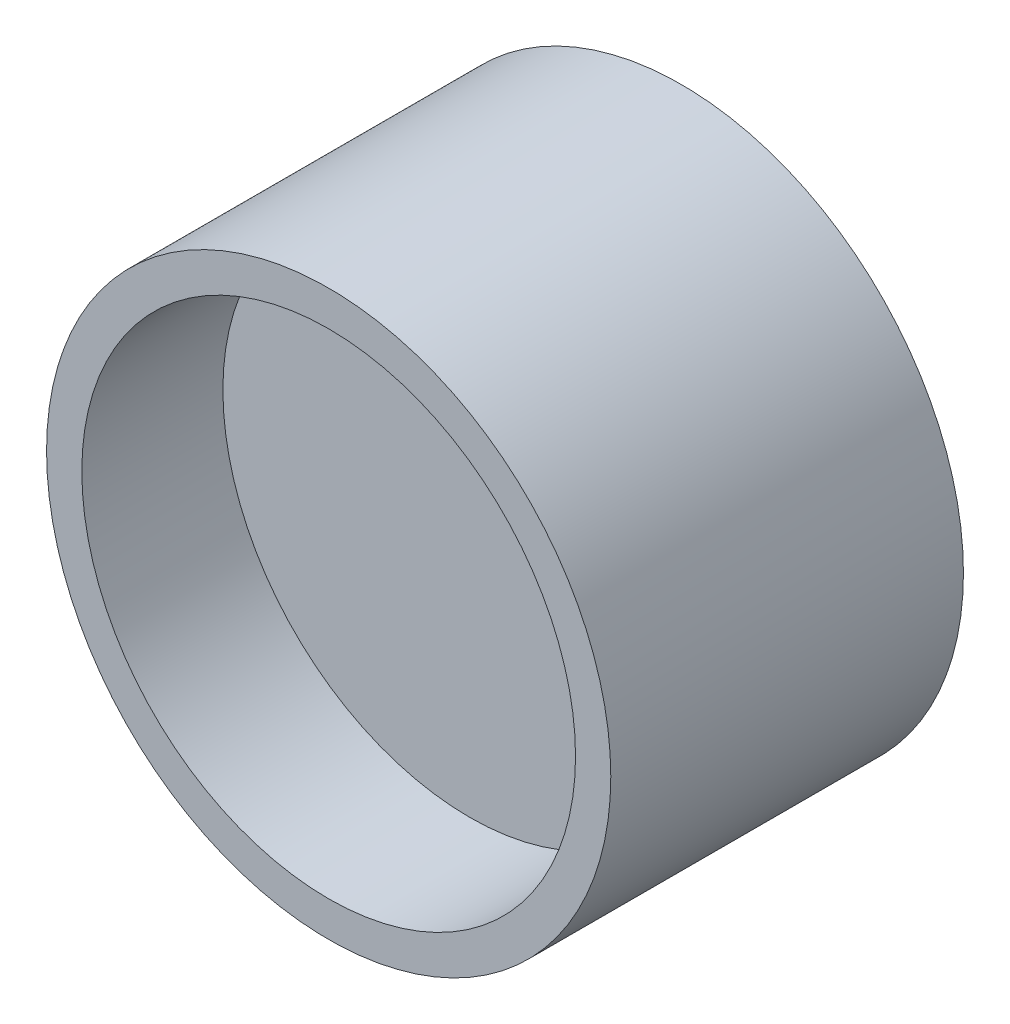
from build123d import *

# Parameters (mm, degrees)
SKETCH1_R           = 40
BOSS_EXTRUDE1_DEPTH = 50
SKETCH2_R           = 35
CUT_EXTRUDE1_DEPTH  = 20


with BuildPart() as part:
    # Sketch1 → Boss-Extrude1 (new body)
    with BuildSketch(Plane.XY):
        Circle(SKETCH1_R)
    extrude(amount=BOSS_EXTRUDE1_DEPTH)

    # Sketch2 → Cut-Extrude1 (cut)
    with BuildSketch(Plane.XY.offset(50)):
        Circle(SKETCH2_R)
    extrude(amount=-CUT_EXTRUDE1_DEPTH, mode=Mode.SUBTRACT)


solid = part.part
